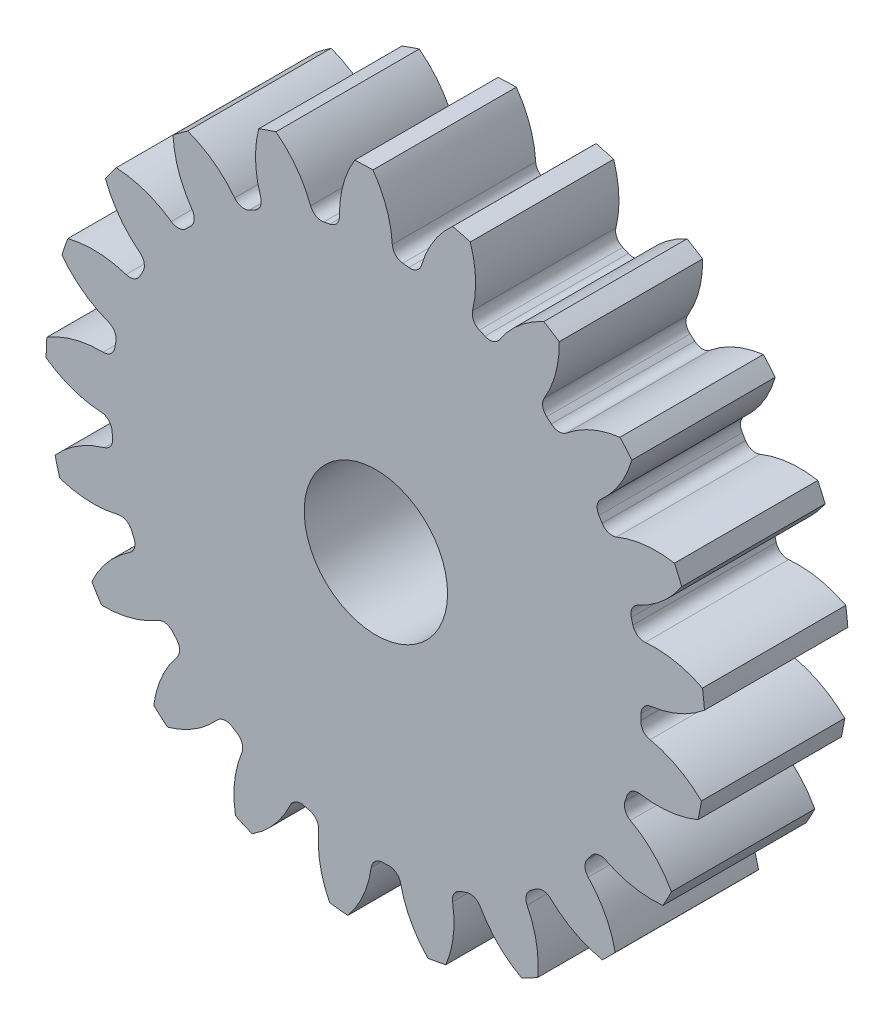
from build123d import *

# Parameters (mm, degrees)
SKETCH3_R         = 233.68
GEARBODY_DEPTH    = 101.6
TOOTHCUT_DEPTH    = 346.738694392
CIRPATTERN1_COUNT = 21
BOREDIA_R         = 50.8
BORE_DEPTH        = 12700


with BuildPart() as part:
    # Sketch3 → gearBody (new body)
    with BuildSketch(Plane.XY):
        Circle(SKETCH3_R)
    extrude(amount=GEARBODY_DEPTH)

    # Sketch2 → toothCut (cut, through all)
    with BuildSketch(Plane.XY):
        with BuildLine():
            ThreePointArc((187.727339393, -9.349205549), (187.822380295, -7.19131839), (187.892617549, -5.032481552))
            ThreePointArc((187.892617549, -5.032481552), (190.011052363, 0.276788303), (195.067051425, 2.943806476))
            ThreePointArc((195.067051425, 2.943806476), (215.626390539, 8.77984135), (233.68, 20.21718865))
            ThreePointArc((233.68, 20.21718865), (234.381196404, -8.973956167), (231.449991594, -38.026024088))
            ThreePointArc((231.449991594, -38.026024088), (214.323777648, -25.241716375), (194.27087315, -17.850725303))
            ThreePointArc((194.27087315, -17.850725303), (189.433606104, -14.804915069), (187.727339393, -9.349205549))
        make_face()
    toothcut = extrude(amount=TOOTHCUT_DEPTH, mode=Mode.SUBTRACT)

    # CirPattern1: toothCut ×21 about axis
    cirpattern1_axis = Axis((0, 0, 0), (0, 0, 1))
    for i in range(1, CIRPATTERN1_COUNT):
        add(toothcut.rotate(cirpattern1_axis, i * 360 / CIRPATTERN1_COUNT), mode=Mode.SUBTRACT)

    # boreDia → bore (cut, symmetric)
    with BuildSketch(Plane.XY):
        Circle(BOREDIA_R)
    extrude(amount=BORE_DEPTH, both=True, mode=Mode.SUBTRACT)


solid = part.part
